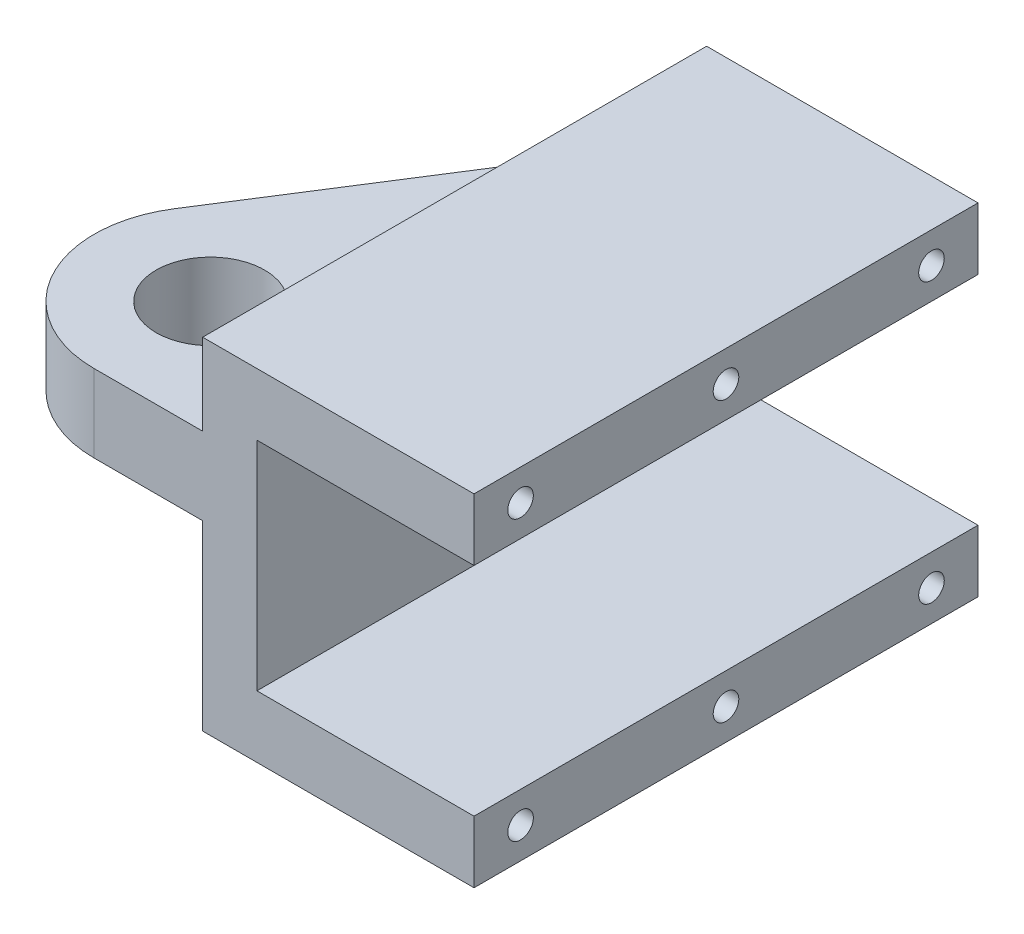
ISO-10303-21;
HEADER;
FILE_DESCRIPTION(('STEP AP214'),'2;1');
FILE_NAME('part.step','',(''),(''),'','','');
FILE_SCHEMA(('AUTOMOTIVE_DESIGN { 1 0 10303 214 1 1 1 1 }'));
ENDSEC;
DATA;
#1=APPLICATION_CONTEXT('core data for automotive mechanical design processes');
#2=APPLICATION_PROTOCOL_DEFINITION('international standard','automotive_design',2000,#1);
#3=PRODUCT_CONTEXT('',#1,'mechanical');
#4=PRODUCT('Part','Part','',(#3));
#5=PRODUCT_RELATED_PRODUCT_CATEGORY('part','',(#4));
#6=PRODUCT_DEFINITION_FORMATION('','',#4);
#7=PRODUCT_DEFINITION_CONTEXT('part definition',#1,'design');
#8=PRODUCT_DEFINITION('design','',#6,#7);
#9=PRODUCT_DEFINITION_SHAPE('','',#8);
#10=(LENGTH_UNIT() NAMED_UNIT(*) SI_UNIT(.MILLI.,.METRE.));
#11=(NAMED_UNIT(*) PLANE_ANGLE_UNIT() SI_UNIT($,.RADIAN.));
#12=(NAMED_UNIT(*) SI_UNIT($,.STERADIAN.) SOLID_ANGLE_UNIT());
#13=UNCERTAINTY_MEASURE_WITH_UNIT(LENGTH_MEASURE(1.E-05),#10,'distance_accuracy_value','');
#14=(GEOMETRIC_REPRESENTATION_CONTEXT(3) GLOBAL_UNCERTAINTY_ASSIGNED_CONTEXT((#13)) GLOBAL_UNIT_ASSIGNED_CONTEXT((#10,
#11,#12)) REPRESENTATION_CONTEXT('',''));
#15=CARTESIAN_POINT('',(0.,0.,0.));
#16=DIRECTION('',(0.,0.,1.));
#17=DIRECTION('',(1.,0.,0.));
#18=AXIS2_PLACEMENT_3D('',#15,#16,#17);
#19=CARTESIAN_POINT('',(2.49999999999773,18.,26.5));
#20=DIRECTION('',(1.,0.,0.));
#21=DIRECTION('',(0.,0.,-1.));
#22=AXIS2_PLACEMENT_3D('',#19,#20,#21);
#23=CONICAL_SURFACE('',#22,1.64999999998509,1.04719755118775);
#24=CARTESIAN_POINT('',(1.54737205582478,18.,26.5));
#25=VERTEX_POINT('',#24);
#26=VERTEX_LOOP('',#25);
#27=FACE_BOUND('',#26,.T.);
#28=CARTESIAN_POINT('',(2.5,18.,26.5));
#29=DIRECTION('',(1.,0.,0.));
#30=DIRECTION('',(0.,0.,-1.));
#31=AXIS2_PLACEMENT_3D('',#28,#29,#30);
#32=CIRCLE('',#31,1.65);
#33=CARTESIAN_POINT('',(2.5,18.,24.85));
#34=VERTEX_POINT('',#33);
#35=EDGE_CURVE('E286',#34,#34,#32,.T.);
#36=ORIENTED_EDGE('',*,*,#35,.T.);
#37=EDGE_LOOP('',(#36));
#38=FACE_BOUND('',#37,.T.);
#39=ADVANCED_FACE('F15',(#27,#38),#23,.F.);
#40=CARTESIAN_POINT('',(2.49999999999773,18.,0.));
#41=DIRECTION('',(1.,0.,0.));
#42=DIRECTION('',(0.,0.,-1.));
#43=AXIS2_PLACEMENT_3D('',#40,#41,#42);
#44=CONICAL_SURFACE('',#43,1.64999999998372,1.04719755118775);
#45=CARTESIAN_POINT('',(1.54737205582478,18.,0.));
#46=VERTEX_POINT('',#45);
#47=VERTEX_LOOP('',#46);
#48=FACE_BOUND('',#47,.T.);
#49=CARTESIAN_POINT('',(2.5,18.,0.));
#50=DIRECTION('',(1.,0.,0.));
#51=DIRECTION('',(0.,0.,-1.));
#52=AXIS2_PLACEMENT_3D('',#49,#50,#51);
#53=CIRCLE('',#52,1.65);
#54=CARTESIAN_POINT('',(2.5,18.,-1.65));
#55=VERTEX_POINT('',#54);
#56=EDGE_CURVE('E283',#55,#55,#53,.T.);
#57=ORIENTED_EDGE('',*,*,#56,.T.);
#58=EDGE_LOOP('',(#57));
#59=FACE_BOUND('',#58,.T.);
#60=ADVANCED_FACE('F578',(#48,#59),#44,.F.);
#61=CARTESIAN_POINT('',(2.49999999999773,18.,-26.5));
#62=DIRECTION('',(1.,0.,0.));
#63=DIRECTION('',(0.,0.,-1.));
#64=AXIS2_PLACEMENT_3D('',#61,#62,#63);
#65=CONICAL_SURFACE('',#64,1.64999999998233,1.04719755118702);
#66=CARTESIAN_POINT('',(1.54737205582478,18.,-26.5));
#67=VERTEX_POINT('',#66);
#68=VERTEX_LOOP('',#67);
#69=FACE_BOUND('',#68,.T.);
#70=CARTESIAN_POINT('',(2.5,18.,-26.5));
#71=DIRECTION('',(1.,0.,0.));
#72=DIRECTION('',(0.,0.,-1.));
#73=AXIS2_PLACEMENT_3D('',#70,#71,#72);
#74=CIRCLE('',#73,1.65);
#75=CARTESIAN_POINT('',(2.5,18.,-28.15));
#76=VERTEX_POINT('',#75);
#77=EDGE_CURVE('E280',#76,#76,#74,.T.);
#78=ORIENTED_EDGE('',*,*,#77,.T.);
#79=EDGE_LOOP('',(#78));
#80=FACE_BOUND('',#79,.T.);
#81=ADVANCED_FACE('F569',(#69,#80),#65,.F.);
#82=CARTESIAN_POINT('',(-35.,1.5,17.5));
#83=DIRECTION('',(0.,1.,0.));
#84=DIRECTION('',(0.,0.,1.));
#85=AXIS2_PLACEMENT_3D('',#82,#83,#84);
#86=CYLINDRICAL_SURFACE('',#85,7.);
#87=CARTESIAN_POINT('',(-35.,11.5,17.5));
#88=DIRECTION('',(0.,1.,0.));
#89=DIRECTION('',(0.,0.,1.));
#90=AXIS2_PLACEMENT_3D('',#87,#88,#89);
#91=CIRCLE('',#90,7.);
#92=CARTESIAN_POINT('',(-35.,11.5,24.5));
#93=VERTEX_POINT('',#92);
#94=EDGE_CURVE('E18',#93,#93,#91,.T.);
#95=ORIENTED_EDGE('',*,*,#94,.T.);
#96=EDGE_LOOP('',(#95));
#97=FACE_BOUND('',#96,.T.);
#98=CARTESIAN_POINT('',(-35.,1.5,17.5));
#99=DIRECTION('',(0.,1.,0.));
#100=DIRECTION('',(0.,0.,1.));
#101=AXIS2_PLACEMENT_3D('',#98,#99,#100);
#102=CIRCLE('',#101,7.);
#103=CARTESIAN_POINT('',(-35.,1.5,24.5));
#104=VERTEX_POINT('',#103);
#105=EDGE_CURVE('E279',#104,#104,#102,.T.);
#106=ORIENTED_EDGE('',*,*,#105,.F.);
#107=EDGE_LOOP('',(#106));
#108=FACE_BOUND('',#107,.T.);
#109=ADVANCED_FACE('F560',(#97,#108),#86,.F.);
#110=CARTESIAN_POINT('',(2.49999999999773,-18.,-26.5));
#111=DIRECTION('',(1.,0.,0.));
#112=DIRECTION('',(0.,0.,-1.));
#113=AXIS2_PLACEMENT_3D('',#110,#111,#112);
#114=CONICAL_SURFACE('',#113,1.64999999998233,1.04719755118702);
#115=CARTESIAN_POINT('',(1.54737205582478,-18.,-26.5));
#116=VERTEX_POINT('',#115);
#117=VERTEX_LOOP('',#116);
#118=FACE_BOUND('',#117,.T.);
#119=CARTESIAN_POINT('',(2.5,-18.,-26.5));
#120=DIRECTION('',(1.,0.,0.));
#121=DIRECTION('',(0.,0.,-1.));
#122=AXIS2_PLACEMENT_3D('',#119,#120,#121);
#123=CIRCLE('',#122,1.65);
#124=CARTESIAN_POINT('',(2.5,-18.,-28.15));
#125=VERTEX_POINT('',#124);
#126=EDGE_CURVE('E276',#125,#125,#123,.T.);
#127=ORIENTED_EDGE('',*,*,#126,.T.);
#128=EDGE_LOOP('',(#127));
#129=FACE_BOUND('',#128,.T.);
#130=ADVANCED_FACE('F551',(#118,#129),#114,.F.);
#131=CARTESIAN_POINT('',(2.49999999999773,-18.,0.));
#132=DIRECTION('',(1.,0.,0.));
#133=DIRECTION('',(0.,0.,-1.));
#134=AXIS2_PLACEMENT_3D('',#131,#132,#133);
#135=CONICAL_SURFACE('',#134,1.64999999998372,1.04719755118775);
#136=CARTESIAN_POINT('',(1.54737205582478,-18.,0.));
#137=VERTEX_POINT('',#136);
#138=VERTEX_LOOP('',#137);
#139=FACE_BOUND('',#138,.T.);
#140=CARTESIAN_POINT('',(2.5,-18.,0.));
#141=DIRECTION('',(1.,0.,0.));
#142=DIRECTION('',(0.,0.,-1.));
#143=AXIS2_PLACEMENT_3D('',#140,#141,#142);
#144=CIRCLE('',#143,1.65);
#145=CARTESIAN_POINT('',(2.5,-18.,-1.65));
#146=VERTEX_POINT('',#145);
#147=EDGE_CURVE('E273',#146,#146,#144,.T.);
#148=ORIENTED_EDGE('',*,*,#147,.T.);
#149=EDGE_LOOP('',(#148));
#150=FACE_BOUND('',#149,.T.);
#151=ADVANCED_FACE('F542',(#139,#150),#135,.F.);
#152=CARTESIAN_POINT('',(2.49999999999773,-18.,26.5));
#153=DIRECTION('',(1.,0.,0.));
#154=DIRECTION('',(0.,0.,-1.));
#155=AXIS2_PLACEMENT_3D('',#152,#153,#154);
#156=CONICAL_SURFACE('',#155,1.64999999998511,1.04719755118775);
#157=CARTESIAN_POINT('',(1.54737205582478,-18.,26.5));
#158=VERTEX_POINT('',#157);
#159=VERTEX_LOOP('',#158);
#160=FACE_BOUND('',#159,.T.);
#161=CARTESIAN_POINT('',(2.5,-18.,26.5));
#162=DIRECTION('',(1.,0.,0.));
#163=DIRECTION('',(0.,0.,-1.));
#164=AXIS2_PLACEMENT_3D('',#161,#162,#163);
#165=CIRCLE('',#164,1.65);
#166=CARTESIAN_POINT('',(2.5,-18.,24.85));
#167=VERTEX_POINT('',#166);
#168=EDGE_CURVE('E269',#167,#167,#165,.T.);
#169=ORIENTED_EDGE('',*,*,#168,.T.);
#170=EDGE_LOOP('',(#169));
#171=FACE_BOUND('',#170,.T.);
#172=ADVANCED_FACE('F531',(#160,#171),#156,.F.);
#173=CARTESIAN_POINT('',(14.,18.,26.5));
#174=DIRECTION('',(1.,0.,0.));
#175=DIRECTION('',(0.,0.,-1.));
#176=AXIS2_PLACEMENT_3D('',#173,#174,#175);
#177=CYLINDRICAL_SURFACE('',#176,1.65);
#178=CARTESIAN_POINT('',(14.,18.,26.5));
#179=DIRECTION('',(1.,0.,0.));
#180=DIRECTION('',(0.,0.,-1.));
#181=AXIS2_PLACEMENT_3D('',#178,#179,#180);
#182=CIRCLE('',#181,1.65);
#183=CARTESIAN_POINT('',(14.,18.,24.85));
#184=VERTEX_POINT('',#183);
#185=EDGE_CURVE('E272',#184,#184,#182,.T.);
#186=ORIENTED_EDGE('',*,*,#185,.T.);
#187=EDGE_LOOP('',(#186));
#188=FACE_BOUND('',#187,.T.);
#189=ORIENTED_EDGE('',*,*,#35,.F.);
#190=EDGE_LOOP('',(#189));
#191=FACE_BOUND('',#190,.T.);
#192=ADVANCED_FACE('F521',(#188,#191),#177,.F.);
#193=CARTESIAN_POINT('',(14.,18.,0.));
#194=DIRECTION('',(1.,0.,0.));
#195=DIRECTION('',(0.,0.,-1.));
#196=AXIS2_PLACEMENT_3D('',#193,#194,#195);
#197=CYLINDRICAL_SURFACE('',#196,1.65);
#198=CARTESIAN_POINT('',(14.,18.,0.));
#199=DIRECTION('',(1.,0.,0.));
#200=DIRECTION('',(0.,0.,-1.));
#201=AXIS2_PLACEMENT_3D('',#198,#199,#200);
#202=CIRCLE('',#201,1.65);
#203=CARTESIAN_POINT('',(14.,18.,-1.65));
#204=VERTEX_POINT('',#203);
#205=EDGE_CURVE('E299',#204,#204,#202,.T.);
#206=ORIENTED_EDGE('',*,*,#205,.T.);
#207=EDGE_LOOP('',(#206));
#208=FACE_BOUND('',#207,.T.);
#209=ORIENTED_EDGE('',*,*,#56,.F.);
#210=EDGE_LOOP('',(#209));
#211=FACE_BOUND('',#210,.T.);
#212=ADVANCED_FACE('F512',(#208,#211),#197,.F.);
#213=CARTESIAN_POINT('',(14.,18.,-26.5));
#214=DIRECTION('',(1.,0.,0.));
#215=DIRECTION('',(0.,0.,-1.));
#216=AXIS2_PLACEMENT_3D('',#213,#214,#215);
#217=CYLINDRICAL_SURFACE('',#216,1.65);
#218=CARTESIAN_POINT('',(14.,18.,-26.5));
#219=DIRECTION('',(1.,0.,0.));
#220=DIRECTION('',(0.,0.,-1.));
#221=AXIS2_PLACEMENT_3D('',#218,#219,#220);
#222=CIRCLE('',#221,1.65);
#223=CARTESIAN_POINT('',(14.,18.,-28.15));
#224=VERTEX_POINT('',#223);
#225=EDGE_CURVE('E195',#224,#224,#222,.T.);
#226=ORIENTED_EDGE('',*,*,#225,.T.);
#227=EDGE_LOOP('',(#226));
#228=FACE_BOUND('',#227,.T.);
#229=ORIENTED_EDGE('',*,*,#77,.F.);
#230=EDGE_LOOP('',(#229));
#231=FACE_BOUND('',#230,.T.);
#232=ADVANCED_FACE('F503',(#228,#231),#217,.F.);
#233=CARTESIAN_POINT('',(-35.,11.5,17.5));
#234=DIRECTION('',(0.,-1.,0.));
#235=DIRECTION('',(0.,0.,-1.));
#236=AXIS2_PLACEMENT_3D('',#233,#234,#235);
#237=PLANE('',#236);
#238=ORIENTED_EDGE('',*,*,#94,.F.);
#239=EDGE_LOOP('',(#238));
#240=FACE_BOUND('',#239,.T.);
#241=DIRECTION('',(1.,0.,0.));
#242=VECTOR('',#241,1.);
#243=CARTESIAN_POINT('',(-14.,11.5,32.5));
#244=LINE('',#243,#242);
#245=CARTESIAN_POINT('',(-21.,11.5,32.5));
#246=VERTEX_POINT('',#245);
#247=CARTESIAN_POINT('',(-35.,11.5,32.5));
#248=VERTEX_POINT('',#247);
#249=EDGE_CURVE('E119',#246,#248,#244,.F.);
#250=ORIENTED_EDGE('',*,*,#249,.F.);
#251=DIRECTION('',(0.,0.,-1.));
#252=VECTOR('',#251,1.);
#253=CARTESIAN_POINT('',(-21.,11.5,32.5));
#254=LINE('',#253,#252);
#255=CARTESIAN_POINT('',(-21.,11.5,-32.5));
#256=VERTEX_POINT('',#255);
#257=EDGE_CURVE('E169',#246,#256,#254,.T.);
#258=ORIENTED_EDGE('',*,*,#257,.T.);
#259=DIRECTION('',(0.536323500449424,0.,-0.844012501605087));
#260=VECTOR('',#259,1.);
#261=CARTESIAN_POINT('',(-47.6601875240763,11.5,9.45514749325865));
#262=LINE('',#261,#260);
#263=CARTESIAN_POINT('',(-47.6601875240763,11.5,9.45514749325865));
#264=VERTEX_POINT('',#263);
#265=EDGE_CURVE('E135',#256,#264,#262,.F.);
#266=ORIENTED_EDGE('',*,*,#265,.T.);
#267=CARTESIAN_POINT('',(-35.,11.5,17.5));
#268=DIRECTION('',(0.,1.,0.));
#269=DIRECTION('',(0.,0.,1.));
#270=AXIS2_PLACEMENT_3D('',#267,#268,#269);
#271=CIRCLE('',#270,15.);
#272=EDGE_CURVE('E133',#248,#264,#271,.F.);
#273=ORIENTED_EDGE('',*,*,#272,.F.);
#274=EDGE_LOOP('',(#250,#258,#266,#273));
#275=FACE_BOUND('',#274,.T.);
#276=ADVANCED_FACE('F134',(#240,#275),#237,.F.);
#277=CARTESIAN_POINT('',(-35.,1.5,17.5));
#278=DIRECTION('',(0.,1.,0.));
#279=DIRECTION('',(0.,0.,1.));
#280=AXIS2_PLACEMENT_3D('',#277,#278,#279);
#281=CYLINDRICAL_SURFACE('',#280,15.);
#282=CARTESIAN_POINT('',(-35.,1.5,17.5));
#283=DIRECTION('',(0.,1.,0.));
#284=DIRECTION('',(0.,0.,1.));
#285=AXIS2_PLACEMENT_3D('',#282,#283,#284);
#286=CIRCLE('',#285,15.);
#287=CARTESIAN_POINT('',(-35.,1.5,32.5));
#288=VERTEX_POINT('',#287);
#289=CARTESIAN_POINT('',(-47.6601875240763,1.5,9.45514749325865));
#290=VERTEX_POINT('',#289);
#291=EDGE_CURVE('E139',#288,#290,#286,.F.);
#292=ORIENTED_EDGE('',*,*,#291,.F.);
#293=DIRECTION('',(0.,1.,0.));
#294=VECTOR('',#293,1.);
#295=CARTESIAN_POINT('',(-35.,14.,32.5));
#296=LINE('',#295,#294);
#297=EDGE_CURVE('E124',#248,#288,#296,.F.);
#298=ORIENTED_EDGE('',*,*,#297,.F.);
#299=ORIENTED_EDGE('',*,*,#272,.T.);
#300=DIRECTION('',(0.,1.,0.));
#301=VECTOR('',#300,1.);
#302=CARTESIAN_POINT('',(-47.6601875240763,1.5,9.45514749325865));
#303=LINE('',#302,#301);
#304=EDGE_CURVE('E177',#264,#290,#303,.F.);
#305=ORIENTED_EDGE('',*,*,#304,.T.);
#306=EDGE_LOOP('',(#292,#298,#299,#305));
#307=FACE_BOUND('',#306,.T.);
#308=ADVANCED_FACE('F140',(#307),#281,.T.);
#309=CARTESIAN_POINT('',(-35.,1.5,17.5));
#310=DIRECTION('',(0.,-1.,0.));
#311=DIRECTION('',(0.,0.,-1.));
#312=AXIS2_PLACEMENT_3D('',#309,#310,#311);
#313=PLANE('',#312);
#314=ORIENTED_EDGE('',*,*,#105,.T.);
#315=EDGE_LOOP('',(#314));
#316=FACE_BOUND('',#315,.T.);
#317=DIRECTION('',(0.,0.,-1.));
#318=VECTOR('',#317,1.);
#319=CARTESIAN_POINT('',(-21.,1.5,32.5));
#320=LINE('',#319,#318);
#321=CARTESIAN_POINT('',(-21.,1.5,-32.5));
#322=VERTEX_POINT('',#321);
#323=CARTESIAN_POINT('',(-21.,1.5,32.5));
#324=VERTEX_POINT('',#323);
#325=EDGE_CURVE('E152',#322,#324,#320,.F.);
#326=ORIENTED_EDGE('',*,*,#325,.T.);
#327=DIRECTION('',(1.,0.,0.));
#328=VECTOR('',#327,1.);
#329=CARTESIAN_POINT('',(-14.,1.5,32.5));
#330=LINE('',#329,#328);
#331=EDGE_CURVE('E142',#288,#324,#330,.T.);
#332=ORIENTED_EDGE('',*,*,#331,.F.);
#333=ORIENTED_EDGE('',*,*,#291,.T.);
#334=DIRECTION('',(0.536323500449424,0.,-0.844012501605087));
#335=VECTOR('',#334,1.);
#336=CARTESIAN_POINT('',(-47.6601875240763,1.5,9.45514749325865));
#337=LINE('',#336,#335);
#338=EDGE_CURVE('E218',#290,#322,#337,.T.);
#339=ORIENTED_EDGE('',*,*,#338,.T.);
#340=EDGE_LOOP('',(#326,#332,#333,#339));
#341=FACE_BOUND('',#340,.T.);
#342=ADVANCED_FACE('F308',(#316,#341),#313,.T.);
#343=CARTESIAN_POINT('',(14.,-18.,-26.5));
#344=DIRECTION('',(1.,0.,0.));
#345=DIRECTION('',(0.,0.,-1.));
#346=AXIS2_PLACEMENT_3D('',#343,#344,#345);
#347=CYLINDRICAL_SURFACE('',#346,1.65);
#348=CARTESIAN_POINT('',(14.,-18.,-26.5));
#349=DIRECTION('',(1.,0.,0.));
#350=DIRECTION('',(0.,0.,-1.));
#351=AXIS2_PLACEMENT_3D('',#348,#349,#350);
#352=CIRCLE('',#351,1.65);
#353=CARTESIAN_POINT('',(14.,-18.,-28.15));
#354=VERTEX_POINT('',#353);
#355=EDGE_CURVE('E215',#354,#354,#352,.T.);
#356=ORIENTED_EDGE('',*,*,#355,.T.);
#357=EDGE_LOOP('',(#356));
#358=FACE_BOUND('',#357,.T.);
#359=ORIENTED_EDGE('',*,*,#126,.F.);
#360=EDGE_LOOP('',(#359));
#361=FACE_BOUND('',#360,.T.);
#362=ADVANCED_FACE('F468',(#358,#361),#347,.F.);
#363=CARTESIAN_POINT('',(14.,-18.,0.));
#364=DIRECTION('',(1.,0.,0.));
#365=DIRECTION('',(0.,0.,-1.));
#366=AXIS2_PLACEMENT_3D('',#363,#364,#365);
#367=CYLINDRICAL_SURFACE('',#366,1.65);
#368=CARTESIAN_POINT('',(14.,-18.,0.));
#369=DIRECTION('',(1.,0.,0.));
#370=DIRECTION('',(0.,0.,-1.));
#371=AXIS2_PLACEMENT_3D('',#368,#369,#370);
#372=CIRCLE('',#371,1.65);
#373=CARTESIAN_POINT('',(14.,-18.,-1.65));
#374=VERTEX_POINT('',#373);
#375=EDGE_CURVE('E292',#374,#374,#372,.T.);
#376=ORIENTED_EDGE('',*,*,#375,.T.);
#377=EDGE_LOOP('',(#376));
#378=FACE_BOUND('',#377,.T.);
#379=ORIENTED_EDGE('',*,*,#147,.F.);
#380=EDGE_LOOP('',(#379));
#381=FACE_BOUND('',#380,.T.);
#382=ADVANCED_FACE('F458',(#378,#381),#367,.F.);
#383=CARTESIAN_POINT('',(14.,-18.,26.5));
#384=DIRECTION('',(1.,0.,0.));
#385=DIRECTION('',(0.,0.,-1.));
#386=AXIS2_PLACEMENT_3D('',#383,#384,#385);
#387=CYLINDRICAL_SURFACE('',#386,1.65);
#388=CARTESIAN_POINT('',(14.,-18.,26.5));
#389=DIRECTION('',(1.,0.,0.));
#390=DIRECTION('',(0.,0.,-1.));
#391=AXIS2_PLACEMENT_3D('',#388,#389,#390);
#392=CIRCLE('',#391,1.65);
#393=CARTESIAN_POINT('',(14.,-18.,24.85));
#394=VERTEX_POINT('',#393);
#395=EDGE_CURVE('E289',#394,#394,#392,.T.);
#396=ORIENTED_EDGE('',*,*,#395,.T.);
#397=EDGE_LOOP('',(#396));
#398=FACE_BOUND('',#397,.T.);
#399=ORIENTED_EDGE('',*,*,#168,.F.);
#400=EDGE_LOOP('',(#399));
#401=FACE_BOUND('',#400,.T.);
#402=ADVANCED_FACE('F449',(#398,#401),#387,.F.);
#403=CARTESIAN_POINT('',(-14.,14.,32.5));
#404=DIRECTION('',(0.,1.,0.));
#405=DIRECTION('',(-1.,0.,0.));
#406=AXIS2_PLACEMENT_3D('',#403,#404,#405);
#407=PLANE('',#406);
#408=DIRECTION('',(0.,0.,1.));
#409=VECTOR('',#408,1.);
#410=CARTESIAN_POINT('',(14.,14.,32.5));
#411=LINE('',#410,#409);
#412=CARTESIAN_POINT('',(14.,14.,-32.5));
#413=VERTEX_POINT('',#412);
#414=CARTESIAN_POINT('',(14.,14.,32.5));
#415=VERTEX_POINT('',#414);
#416=EDGE_CURVE('E186',#413,#415,#411,.T.);
#417=ORIENTED_EDGE('',*,*,#416,.T.);
#418=DIRECTION('',(1.,0.,0.));
#419=VECTOR('',#418,1.);
#420=CARTESIAN_POINT('',(-14.,14.,32.5));
#421=LINE('',#420,#419);
#422=CARTESIAN_POINT('',(-14.,14.,32.5));
#423=VERTEX_POINT('',#422);
#424=EDGE_CURVE('E190',#423,#415,#421,.T.);
#425=ORIENTED_EDGE('',*,*,#424,.F.);
#426=DIRECTION('',(0.,0.,1.));
#427=VECTOR('',#426,1.);
#428=CARTESIAN_POINT('',(-14.,14.,32.5));
#429=LINE('',#428,#427);
#430=CARTESIAN_POINT('',(-14.,14.,-32.5));
#431=VERTEX_POINT('',#430);
#432=EDGE_CURVE('E156',#423,#431,#429,.F.);
#433=ORIENTED_EDGE('',*,*,#432,.T.);
#434=DIRECTION('',(1.,0.,0.));
#435=VECTOR('',#434,1.);
#436=CARTESIAN_POINT('',(-14.,14.,-32.5));
#437=LINE('',#436,#435);
#438=EDGE_CURVE('E234',#431,#413,#437,.T.);
#439=ORIENTED_EDGE('',*,*,#438,.T.);
#440=EDGE_LOOP('',(#417,#425,#433,#439));
#441=FACE_BOUND('',#440,.T.);
#442=ADVANCED_FACE('F328',(#441),#407,.F.);
#443=CARTESIAN_POINT('',(14.,22.,32.5));
#444=DIRECTION('',(-1.,0.,0.));
#445=DIRECTION('',(0.,-1.,0.));
#446=AXIS2_PLACEMENT_3D('',#443,#444,#445);
#447=PLANE('',#446);
#448=DIRECTION('',(0.,0.,-1.));
#449=VECTOR('',#448,1.);
#450=CARTESIAN_POINT('',(14.,22.,32.5));
#451=LINE('',#450,#449);
#452=CARTESIAN_POINT('',(14.,22.,-32.5));
#453=VERTEX_POINT('',#452);
#454=CARTESIAN_POINT('',(14.,22.,32.5));
#455=VERTEX_POINT('',#454);
#456=EDGE_CURVE('E172',#453,#455,#451,.F.);
#457=ORIENTED_EDGE('',*,*,#456,.T.);
#458=DIRECTION('',(0.,1.,0.));
#459=VECTOR('',#458,1.);
#460=CARTESIAN_POINT('',(14.,14.,32.5));
#461=LINE('',#460,#459);
#462=EDGE_CURVE('E181',#415,#455,#461,.T.);
#463=ORIENTED_EDGE('',*,*,#462,.F.);
#464=ORIENTED_EDGE('',*,*,#416,.F.);
#465=DIRECTION('',(0.,1.,0.));
#466=VECTOR('',#465,1.);
#467=CARTESIAN_POINT('',(14.,14.,-32.5));
#468=LINE('',#467,#466);
#469=EDGE_CURVE('E237',#413,#453,#468,.T.);
#470=ORIENTED_EDGE('',*,*,#469,.T.);
#471=EDGE_LOOP('',(#457,#463,#464,#470));
#472=FACE_BOUND('',#471,.T.);
#473=ORIENTED_EDGE('',*,*,#225,.F.);
#474=EDGE_LOOP('',(#473));
#475=FACE_BOUND('',#474,.T.);
#476=ORIENTED_EDGE('',*,*,#205,.F.);
#477=EDGE_LOOP('',(#476));
#478=FACE_BOUND('',#477,.T.);
#479=ORIENTED_EDGE('',*,*,#185,.F.);
#480=EDGE_LOOP('',(#479));
#481=FACE_BOUND('',#480,.T.);
#482=ADVANCED_FACE('F323',(#472,#475,#478,#481),#447,.F.);
#483=CARTESIAN_POINT('',(-21.,22.,32.5));
#484=DIRECTION('',(0.,-1.,0.));
#485=DIRECTION('',(0.,0.,-1.));
#486=AXIS2_PLACEMENT_3D('',#483,#484,#485);
#487=PLANE('',#486);
#488=DIRECTION('',(0.,0.,-1.));
#489=VECTOR('',#488,1.);
#490=CARTESIAN_POINT('',(-21.,22.,32.5));
#491=LINE('',#490,#489);
#492=CARTESIAN_POINT('',(-21.,22.,-32.5));
#493=VERTEX_POINT('',#492);
#494=CARTESIAN_POINT('',(-21.,22.,32.5));
#495=VERTEX_POINT('',#494);
#496=EDGE_CURVE('E171',#493,#495,#491,.F.);
#497=ORIENTED_EDGE('',*,*,#496,.T.);
#498=DIRECTION('',(1.,0.,0.));
#499=VECTOR('',#498,1.);
#500=CARTESIAN_POINT('',(-14.,22.,32.5));
#501=LINE('',#500,#499);
#502=EDGE_CURVE('E166',#455,#495,#501,.F.);
#503=ORIENTED_EDGE('',*,*,#502,.F.);
#504=ORIENTED_EDGE('',*,*,#456,.F.);
#505=DIRECTION('',(1.,0.,0.));
#506=VECTOR('',#505,1.);
#507=CARTESIAN_POINT('',(-14.,22.,-32.5));
#508=LINE('',#507,#506);
#509=EDGE_CURVE('E258',#453,#493,#508,.F.);
#510=ORIENTED_EDGE('',*,*,#509,.T.);
#511=EDGE_LOOP('',(#497,#503,#504,#510));
#512=FACE_BOUND('',#511,.T.);
#513=ADVANCED_FACE('F320',(#512),#487,.F.);
#514=CARTESIAN_POINT('',(-21.,-22.,32.5));
#515=DIRECTION('',(1.,0.,0.));
#516=DIRECTION('',(0.,0.,-1.));
#517=AXIS2_PLACEMENT_3D('',#514,#515,#516);
#518=PLANE('',#517);
#519=ORIENTED_EDGE('',*,*,#496,.F.);
#520=DIRECTION('',(0.,1.,0.));
#521=VECTOR('',#520,1.);
#522=CARTESIAN_POINT('',(-21.,14.,-32.5));
#523=LINE('',#522,#521);
#524=EDGE_CURVE('E231',#493,#256,#523,.F.);
#525=ORIENTED_EDGE('',*,*,#524,.T.);
#526=ORIENTED_EDGE('',*,*,#257,.F.);
#527=DIRECTION('',(0.,1.,0.));
#528=VECTOR('',#527,1.);
#529=CARTESIAN_POINT('',(-21.,14.,32.5));
#530=LINE('',#529,#528);
#531=EDGE_CURVE('E127',#495,#246,#530,.F.);
#532=ORIENTED_EDGE('',*,*,#531,.F.);
#533=EDGE_LOOP('',(#519,#525,#526,#532));
#534=FACE_BOUND('',#533,.T.);
#535=ADVANCED_FACE('F317',(#534),#518,.F.);
#536=CARTESIAN_POINT('',(-47.6601875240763,1.5,9.45514749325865));
#537=DIRECTION('',(0.844012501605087,0.,0.536323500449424));
#538=DIRECTION('',(0.536323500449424,0.,-0.844012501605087));
#539=AXIS2_PLACEMENT_3D('',#536,#537,#538);
#540=PLANE('',#539);
#541=DIRECTION('',(0.,1.,0.));
#542=VECTOR('',#541,1.);
#543=CARTESIAN_POINT('',(-21.,14.,-32.5));
#544=LINE('',#543,#542);
#545=EDGE_CURVE('E226',#256,#322,#544,.F.);
#546=ORIENTED_EDGE('',*,*,#545,.T.);
#547=ORIENTED_EDGE('',*,*,#338,.F.);
#548=ORIENTED_EDGE('',*,*,#304,.F.);
#549=ORIENTED_EDGE('',*,*,#265,.F.);
#550=EDGE_LOOP('',(#546,#547,#548,#549));
#551=FACE_BOUND('',#550,.T.);
#552=ADVANCED_FACE('F311',(#551),#540,.F.);
#553=CARTESIAN_POINT('',(-14.,-14.,32.5));
#554=DIRECTION('',(0.,-1.,0.));
#555=DIRECTION('',(1.,0.,0.));
#556=AXIS2_PLACEMENT_3D('',#553,#554,#555);
#557=PLANE('',#556);
#558=DIRECTION('',(0.,0.,1.));
#559=VECTOR('',#558,1.);
#560=CARTESIAN_POINT('',(-14.,-14.,32.5));
#561=LINE('',#560,#559);
#562=CARTESIAN_POINT('',(-14.,-14.,-32.5));
#563=VERTEX_POINT('',#562);
#564=CARTESIAN_POINT('',(-14.,-14.,32.5));
#565=VERTEX_POINT('',#564);
#566=EDGE_CURVE('E207',#563,#565,#561,.T.);
#567=ORIENTED_EDGE('',*,*,#566,.T.);
#568=DIRECTION('',(1.,0.,0.));
#569=VECTOR('',#568,1.);
#570=CARTESIAN_POINT('',(-14.,-14.,32.5));
#571=LINE('',#570,#569);
#572=CARTESIAN_POINT('',(14.,-14.,32.5));
#573=VERTEX_POINT('',#572);
#574=EDGE_CURVE('E160',#573,#565,#571,.F.);
#575=ORIENTED_EDGE('',*,*,#574,.F.);
#576=DIRECTION('',(0.,0.,1.));
#577=VECTOR('',#576,1.);
#578=CARTESIAN_POINT('',(14.,-14.,32.5));
#579=LINE('',#578,#577);
#580=CARTESIAN_POINT('',(14.,-14.,-32.5));
#581=VERTEX_POINT('',#580);
#582=EDGE_CURVE('E238',#573,#581,#579,.F.);
#583=ORIENTED_EDGE('',*,*,#582,.T.);
#584=DIRECTION('',(1.,0.,0.));
#585=VECTOR('',#584,1.);
#586=CARTESIAN_POINT('',(-14.,-14.,-32.5));
#587=LINE('',#586,#585);
#588=EDGE_CURVE('E245',#581,#563,#587,.F.);
#589=ORIENTED_EDGE('',*,*,#588,.T.);
#590=EDGE_LOOP('',(#567,#575,#583,#589));
#591=FACE_BOUND('',#590,.T.);
#592=ADVANCED_FACE('F332',(#591),#557,.F.);
#593=CARTESIAN_POINT('',(-14.,-14.,32.5));
#594=DIRECTION('',(-1.,0.,0.));
#595=DIRECTION('',(0.,0.,1.));
#596=AXIS2_PLACEMENT_3D('',#593,#594,#595);
#597=PLANE('',#596);
#598=ORIENTED_EDGE('',*,*,#432,.F.);
#599=DIRECTION('',(0.,1.,0.));
#600=VECTOR('',#599,1.);
#601=CARTESIAN_POINT('',(-14.,14.,32.5));
#602=LINE('',#601,#600);
#603=EDGE_CURVE('E155',#565,#423,#602,.T.);
#604=ORIENTED_EDGE('',*,*,#603,.F.);
#605=ORIENTED_EDGE('',*,*,#566,.F.);
#606=DIRECTION('',(0.,1.,0.));
#607=VECTOR('',#606,1.);
#608=CARTESIAN_POINT('',(-14.,14.,-32.5));
#609=LINE('',#608,#607);
#610=EDGE_CURVE('E241',#563,#431,#609,.T.);
#611=ORIENTED_EDGE('',*,*,#610,.T.);
#612=EDGE_LOOP('',(#598,#604,#605,#611));
#613=FACE_BOUND('',#612,.T.);
#614=ADVANCED_FACE('F353',(#613),#597,.F.);
#615=CARTESIAN_POINT('',(-21.,-22.,32.5));
#616=DIRECTION('',(1.,0.,0.));
#617=DIRECTION('',(0.,0.,-1.));
#618=AXIS2_PLACEMENT_3D('',#615,#616,#617);
#619=PLANE('',#618);
#620=DIRECTION('',(0.,1.,0.));
#621=VECTOR('',#620,1.);
#622=CARTESIAN_POINT('',(-21.,14.,-32.5));
#623=LINE('',#622,#621);
#624=CARTESIAN_POINT('',(-21.,-22.,-32.5));
#625=VERTEX_POINT('',#624);
#626=EDGE_CURVE('E223',#322,#625,#623,.F.);
#627=ORIENTED_EDGE('',*,*,#626,.T.);
#628=DIRECTION('',(0.,0.,1.));
#629=VECTOR('',#628,1.);
#630=CARTESIAN_POINT('',(-21.,-22.,32.5));
#631=LINE('',#630,#629);
#632=CARTESIAN_POINT('',(-21.,-22.,32.5));
#633=VERTEX_POINT('',#632);
#634=EDGE_CURVE('E244',#625,#633,#631,.T.);
#635=ORIENTED_EDGE('',*,*,#634,.T.);
#636=DIRECTION('',(0.,1.,0.));
#637=VECTOR('',#636,1.);
#638=CARTESIAN_POINT('',(-21.,14.,32.5));
#639=LINE('',#638,#637);
#640=EDGE_CURVE('E144',#324,#633,#639,.F.);
#641=ORIENTED_EDGE('',*,*,#640,.F.);
#642=ORIENTED_EDGE('',*,*,#325,.F.);
#643=EDGE_LOOP('',(#627,#635,#641,#642));
#644=FACE_BOUND('',#643,.T.);
#645=ADVANCED_FACE('F351',(#644),#619,.F.);
#646=CARTESIAN_POINT('',(-14.,14.,32.5));
#647=DIRECTION('',(0.,0.,1.));
#648=DIRECTION('',(1.,0.,0.));
#649=AXIS2_PLACEMENT_3D('',#646,#647,#648);
#650=PLANE('',#649);
#651=DIRECTION('',(0.,-1.,0.));
#652=VECTOR('',#651,1.);
#653=CARTESIAN_POINT('',(14.,-22.,32.5));
#654=LINE('',#653,#652);
#655=CARTESIAN_POINT('',(14.,-22.,32.5));
#656=VERTEX_POINT('',#655);
#657=EDGE_CURVE('E147',#656,#573,#654,.F.);
#658=ORIENTED_EDGE('',*,*,#657,.T.);
#659=ORIENTED_EDGE('',*,*,#574,.T.);
#660=ORIENTED_EDGE('',*,*,#603,.T.);
#661=ORIENTED_EDGE('',*,*,#424,.T.);
#662=ORIENTED_EDGE('',*,*,#462,.T.);
#663=ORIENTED_EDGE('',*,*,#502,.T.);
#664=ORIENTED_EDGE('',*,*,#531,.T.);
#665=ORIENTED_EDGE('',*,*,#249,.T.);
#666=ORIENTED_EDGE('',*,*,#297,.T.);
#667=ORIENTED_EDGE('',*,*,#331,.T.);
#668=ORIENTED_EDGE('',*,*,#640,.T.);
#669=DIRECTION('',(1.,0.,0.));
#670=VECTOR('',#669,1.);
#671=CARTESIAN_POINT('',(-21.,-22.,32.5));
#672=LINE('',#671,#670);
#673=EDGE_CURVE('E339',#633,#656,#672,.T.);
#674=ORIENTED_EDGE('',*,*,#673,.T.);
#675=EDGE_LOOP('',(#658,#659,#660,#661,#662,#663,#664,#665,#666,#667,#668,#674));
#676=FACE_BOUND('',#675,.T.);
#677=ADVANCED_FACE('F122',(#676),#650,.T.);
#678=CARTESIAN_POINT('',(14.,-22.,32.5));
#679=DIRECTION('',(-1.,0.,0.));
#680=DIRECTION('',(0.,-1.,0.));
#681=AXIS2_PLACEMENT_3D('',#678,#679,#680);
#682=PLANE('',#681);
#683=ORIENTED_EDGE('',*,*,#582,.F.);
#684=ORIENTED_EDGE('',*,*,#657,.F.);
#685=DIRECTION('',(0.,0.,1.));
#686=VECTOR('',#685,1.);
#687=CARTESIAN_POINT('',(14.,-22.,32.5));
#688=LINE('',#687,#686);
#689=CARTESIAN_POINT('',(14.,-22.,-32.5));
#690=VERTEX_POINT('',#689);
#691=EDGE_CURVE('E24',#656,#690,#688,.F.);
#692=ORIENTED_EDGE('',*,*,#691,.T.);
#693=DIRECTION('',(0.,1.,0.));
#694=VECTOR('',#693,1.);
#695=CARTESIAN_POINT('',(14.,14.,-32.5));
#696=LINE('',#695,#694);
#697=EDGE_CURVE('E32',#690,#581,#696,.T.);
#698=ORIENTED_EDGE('',*,*,#697,.T.);
#699=EDGE_LOOP('',(#683,#684,#692,#698));
#700=FACE_BOUND('',#699,.T.);
#701=ORIENTED_EDGE('',*,*,#395,.F.);
#702=EDGE_LOOP('',(#701));
#703=FACE_BOUND('',#702,.T.);
#704=ORIENTED_EDGE('',*,*,#375,.F.);
#705=EDGE_LOOP('',(#704));
#706=FACE_BOUND('',#705,.T.);
#707=ORIENTED_EDGE('',*,*,#355,.F.);
#708=EDGE_LOOP('',(#707));
#709=FACE_BOUND('',#708,.T.);
#710=ADVANCED_FACE('F344',(#700,#703,#706,#709),#682,.F.);
#711=CARTESIAN_POINT('',(-14.,14.,-32.5));
#712=DIRECTION('',(0.,0.,1.));
#713=DIRECTION('',(1.,0.,0.));
#714=AXIS2_PLACEMENT_3D('',#711,#712,#713);
#715=PLANE('',#714);
#716=ORIENTED_EDGE('',*,*,#588,.F.);
#717=ORIENTED_EDGE('',*,*,#697,.F.);
#718=DIRECTION('',(1.,0.,0.));
#719=VECTOR('',#718,1.);
#720=CARTESIAN_POINT('',(-21.,-22.,-32.5));
#721=LINE('',#720,#719);
#722=EDGE_CURVE('E10',#690,#625,#721,.F.);
#723=ORIENTED_EDGE('',*,*,#722,.T.);
#724=ORIENTED_EDGE('',*,*,#626,.F.);
#725=ORIENTED_EDGE('',*,*,#545,.F.);
#726=ORIENTED_EDGE('',*,*,#524,.F.);
#727=ORIENTED_EDGE('',*,*,#509,.F.);
#728=ORIENTED_EDGE('',*,*,#469,.F.);
#729=ORIENTED_EDGE('',*,*,#438,.F.);
#730=ORIENTED_EDGE('',*,*,#610,.F.);
#731=EDGE_LOOP('',(#716,#717,#723,#724,#725,#726,#727,#728,#729,#730));
#732=FACE_BOUND('',#731,.T.);
#733=ADVANCED_FACE('F314',(#732),#715,.F.);
#734=CARTESIAN_POINT('',(-21.,-22.,32.5));
#735=DIRECTION('',(0.,1.,0.));
#736=DIRECTION('',(0.,0.,1.));
#737=AXIS2_PLACEMENT_3D('',#734,#735,#736);
#738=PLANE('',#737);
#739=ORIENTED_EDGE('',*,*,#691,.F.);
#740=ORIENTED_EDGE('',*,*,#673,.F.);
#741=ORIENTED_EDGE('',*,*,#634,.F.);
#742=ORIENTED_EDGE('',*,*,#722,.F.);
#743=EDGE_LOOP('',(#739,#740,#741,#742));
#744=FACE_BOUND('',#743,.T.);
#745=ADVANCED_FACE('F348',(#744),#738,.F.);
#746=CLOSED_SHELL('',(#39,#60,#81,#109,#130,#151,#172,#192,#212,#232,#276,#308,#342,#362,#382,
#402,#442,#482,#513,#535,#552,#592,#614,#645,#677,#710,#733,#745));
#747=MANIFOLD_SOLID_BREP('B1',#746);
#748=ADVANCED_BREP_SHAPE_REPRESENTATION('',(#18,#747),#14);
#749=SHAPE_DEFINITION_REPRESENTATION(#9,#748);
ENDSEC;
END-ISO-10303-21;
